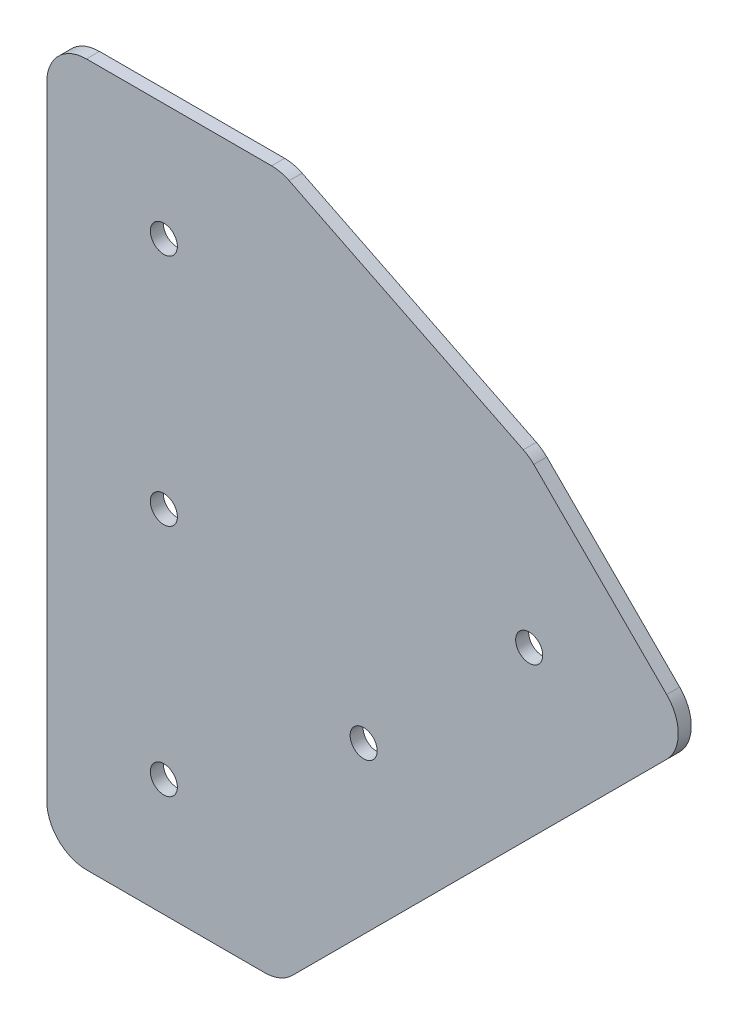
ISO-10303-21;
HEADER;
FILE_DESCRIPTION(('STEP AP214'),'2;1');
FILE_NAME('part.step','',(''),(''),'','','');
FILE_SCHEMA(('AUTOMOTIVE_DESIGN { 1 0 10303 214 1 1 1 1 }'));
ENDSEC;
DATA;
#1=APPLICATION_CONTEXT('core data for automotive mechanical design processes');
#2=APPLICATION_PROTOCOL_DEFINITION('international standard','automotive_design',2000,#1);
#3=PRODUCT_CONTEXT('',#1,'mechanical');
#4=PRODUCT('Part','Part','',(#3));
#5=PRODUCT_RELATED_PRODUCT_CATEGORY('part','',(#4));
#6=PRODUCT_DEFINITION_FORMATION('','',#4);
#7=PRODUCT_DEFINITION_CONTEXT('part definition',#1,'design');
#8=PRODUCT_DEFINITION('design','',#6,#7);
#9=PRODUCT_DEFINITION_SHAPE('','',#8);
#10=(LENGTH_UNIT() NAMED_UNIT(*) SI_UNIT(.MILLI.,.METRE.));
#11=(NAMED_UNIT(*) PLANE_ANGLE_UNIT() SI_UNIT($,.RADIAN.));
#12=(NAMED_UNIT(*) SI_UNIT($,.STERADIAN.) SOLID_ANGLE_UNIT());
#13=UNCERTAINTY_MEASURE_WITH_UNIT(LENGTH_MEASURE(1.E-05),#10,'distance_accuracy_value','');
#14=(GEOMETRIC_REPRESENTATION_CONTEXT(3) GLOBAL_UNCERTAINTY_ASSIGNED_CONTEXT((#13)) GLOBAL_UNIT_ASSIGNED_CONTEXT((#10,
#11,#12)) REPRESENTATION_CONTEXT('',''));
#15=CARTESIAN_POINT('',(0.,0.,0.));
#16=DIRECTION('',(0.,0.,1.));
#17=DIRECTION('',(1.,0.,0.));
#18=AXIS2_PLACEMENT_3D('',#15,#16,#17);
#19=CARTESIAN_POINT('',(59.4458697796,70.157011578,0.));
#20=DIRECTION('',(-0.707106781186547,-0.707106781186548,0.));
#21=DIRECTION('',(0.707106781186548,-0.707106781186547,0.));
#22=AXIS2_PLACEMENT_3D('',#19,#20,#21);
#23=PLANE('',#22);
#24=DIRECTION('',(0.,0.,-1.));
#25=VECTOR('',#24,1.);
#26=CARTESIAN_POINT('',(59.4458697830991,70.1570115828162,0.79375));
#27=LINE('',#26,#25);
#28=CARTESIAN_POINT('',(59.4458697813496,70.1570115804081,0.));
#29=VERTEX_POINT('',#28);
#30=CARTESIAN_POINT('',(59.4458697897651,70.1570115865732,1.5875));
#31=VERTEX_POINT('',#30);
#32=EDGE_CURVE('E159',#29,#31,#27,.F.);
#33=ORIENTED_EDGE('',*,*,#32,.T.);
#34=DIRECTION('',(-0.707106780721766,0.707106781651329,0.));
#35=VECTOR('',#34,1.);
#36=CARTESIAN_POINT('',(75.6652180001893,53.93766336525,1.5875));
#37=LINE('',#36,#35);
#38=CARTESIAN_POINT('',(75.6652180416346,53.9376633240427,1.5875));
#39=VERTEX_POINT('',#38);
#40=EDGE_CURVE('E193',#39,#31,#37,.T.);
#41=ORIENTED_EDGE('',*,*,#40,.F.);
#42=DIRECTION('',(0.,0.,1.));
#43=VECTOR('',#42,1.);
#44=CARTESIAN_POINT('',(75.6652180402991,53.9376633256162,0.79375));
#45=LINE('',#44,#43);
#46=CARTESIAN_POINT('',(75.6652180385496,53.9376633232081,0.));
#47=VERTEX_POINT('',#46);
#48=EDGE_CURVE('E131',#39,#47,#45,.F.);
#49=ORIENTED_EDGE('',*,*,#48,.T.);
#50=DIRECTION('',(0.707106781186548,-0.707106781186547,0.));
#51=VECTOR('',#50,1.);
#52=CARTESIAN_POINT('',(59.4458697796,70.157011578,0.));
#53=LINE('',#52,#51);
#54=EDGE_CURVE('E212',#47,#29,#53,.F.);
#55=ORIENTED_EDGE('',*,*,#54,.T.);
#56=EDGE_LOOP('',(#33,#41,#49,#55));
#57=FACE_BOUND('',#56,.T.);
#58=ADVANCED_FACE('F16',(#57),#23,.F.);
#59=CARTESIAN_POINT('',(56.0221471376,66.733288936,1.5875));
#60=DIRECTION('',(0.,0.,-1.));
#61=DIRECTION('',(0.,1.,0.));
#62=AXIS2_PLACEMENT_3D('',#59,#60,#61);
#63=CYLINDRICAL_SURFACE('',#62,4.84187500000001);
#64=ORIENTED_EDGE('',*,*,#32,.F.);
#65=CARTESIAN_POINT('',(56.0221471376,66.733288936,0.));
#66=DIRECTION('',(0.,0.,-1.));
#67=DIRECTION('',(0.,1.,0.));
#68=AXIS2_PLACEMENT_3D('',#65,#66,#67);
#69=CIRCLE('',#68,4.84187500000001);
#70=CARTESIAN_POINT('',(58.1704515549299,71.0724756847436,0.));
#71=VERTEX_POINT('',#70);
#72=EDGE_CURVE('E209',#29,#71,#69,.F.);
#73=ORIENTED_EDGE('',*,*,#72,.T.);
#74=DIRECTION('',(0.,0.,1.));
#75=VECTOR('',#74,1.);
#76=CARTESIAN_POINT('',(58.1704515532,71.0724756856,0.79375));
#77=LINE('',#76,#75);
#78=CARTESIAN_POINT('',(58.1704515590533,71.0724756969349,1.5875));
#79=VERTEX_POINT('',#78);
#80=EDGE_CURVE('E156',#71,#79,#77,.T.);
#81=ORIENTED_EDGE('',*,*,#80,.T.);
#82=CARTESIAN_POINT('',(56.0221471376,66.733288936,1.5875));
#83=DIRECTION('',(0.,0.,-1.));
#84=DIRECTION('',(0.,1.,0.));
#85=AXIS2_PLACEMENT_3D('',#82,#83,#84);
#86=CIRCLE('',#85,4.84187500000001);
#87=EDGE_CURVE('E191',#31,#79,#86,.F.);
#88=ORIENTED_EDGE('',*,*,#87,.F.);
#89=EDGE_LOOP('',(#64,#73,#81,#88));
#90=FACE_BOUND('',#89,.T.);
#91=ADVANCED_FACE('F295',(#90),#63,.T.);
#92=CARTESIAN_POINT('',(29.5903394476,85.2223117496,0.));
#93=DIRECTION('',(-0.443692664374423,-0.896179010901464,0.));
#94=DIRECTION('',(0.896179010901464,-0.443692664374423,0.));
#95=AXIS2_PLACEMENT_3D('',#92,#93,#94);
#96=PLANE('',#95);
#97=ORIENTED_EDGE('',*,*,#80,.F.);
#98=DIRECTION('',(0.896179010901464,-0.443692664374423,0.));
#99=VECTOR('',#98,1.);
#100=CARTESIAN_POINT('',(29.5903394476,85.2223117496,0.));
#101=LINE('',#100,#99);
#102=CARTESIAN_POINT('',(29.5903394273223,85.2223117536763,0.));
#103=VERTEX_POINT('',#102);
#104=EDGE_CURVE('E207',#71,#103,#101,.F.);
#105=ORIENTED_EDGE('',*,*,#104,.T.);
#106=DIRECTION('',(0.,0.,-1.));
#107=VECTOR('',#106,1.);
#108=CARTESIAN_POINT('',(29.5903394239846,85.2223117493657,0.79375));
#109=LINE('',#108,#107);
#110=CARTESIAN_POINT('',(29.5903394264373,85.2223117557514,1.5875));
#111=VERTEX_POINT('',#110);
#112=EDGE_CURVE('E104',#103,#111,#109,.F.);
#113=ORIENTED_EDGE('',*,*,#112,.T.);
#114=DIRECTION('',(-0.896179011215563,0.443692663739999,0.));
#115=VECTOR('',#114,1.);
#116=CARTESIAN_POINT('',(58.1704515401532,71.072475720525,1.5875));
#117=LINE('',#116,#115);
#118=EDGE_CURVE('E189',#79,#111,#117,.T.);
#119=ORIENTED_EDGE('',*,*,#118,.F.);
#120=EDGE_LOOP('',(#97,#105,#113,#119));
#121=FACE_BOUND('',#120,.T.);
#122=ADVANCED_FACE('F294',(#121),#96,.F.);
#123=CARTESIAN_POINT('',(27.4420350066,80.883125,1.5875));
#124=DIRECTION('',(0.,0.,-1.));
#125=DIRECTION('',(0.,1.,0.));
#126=AXIS2_PLACEMENT_3D('',#123,#124,#125);
#127=CYLINDRICAL_SURFACE('',#126,4.841875);
#128=ORIENTED_EDGE('',*,*,#112,.F.);
#129=CARTESIAN_POINT('',(27.4420350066,80.883125,0.));
#130=DIRECTION('',(0.,0.,-1.));
#131=DIRECTION('',(0.,1.,0.));
#132=AXIS2_PLACEMENT_3D('',#129,#130,#131);
#133=CIRCLE('',#132,4.841875);
#134=CARTESIAN_POINT('',(27.4420350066,85.725,0.));
#135=VERTEX_POINT('',#134);
#136=EDGE_CURVE('E20',#103,#135,#133,.F.);
#137=ORIENTED_EDGE('',*,*,#136,.T.);
#138=DIRECTION('',(0.,0.,1.));
#139=VECTOR('',#138,1.);
#140=CARTESIAN_POINT('',(27.4420350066,85.725,0.79375));
#141=LINE('',#140,#139);
#142=CARTESIAN_POINT('',(27.4420350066,85.725,1.5875));
#143=VERTEX_POINT('',#142);
#144=EDGE_CURVE('E111',#135,#143,#141,.T.);
#145=ORIENTED_EDGE('',*,*,#144,.T.);
#146=CARTESIAN_POINT('',(27.4420350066,80.883125,1.5875));
#147=DIRECTION('',(0.,0.,-1.));
#148=DIRECTION('',(0.,1.,0.));
#149=AXIS2_PLACEMENT_3D('',#146,#147,#148);
#150=CIRCLE('',#149,4.841875);
#151=EDGE_CURVE('E187',#111,#143,#150,.F.);
#152=ORIENTED_EDGE('',*,*,#151,.F.);
#153=EDGE_LOOP('',(#128,#137,#145,#152));
#154=FACE_BOUND('',#153,.T.);
#155=ADVANCED_FACE('F129',(#154),#127,.T.);
#156=CARTESIAN_POINT('',(4.841875,85.725,1.5875));
#157=DIRECTION('',(0.,-1.,0.));
#158=DIRECTION('',(0.,0.,-1.));
#159=AXIS2_PLACEMENT_3D('',#156,#157,#158);
#160=PLANE('',#159);
#161=ORIENTED_EDGE('',*,*,#144,.F.);
#162=DIRECTION('',(-1.,0.,0.));
#163=VECTOR('',#162,1.);
#164=CARTESIAN_POINT('',(38.7729353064,85.725,0.));
#165=LINE('',#164,#163);
#166=CARTESIAN_POINT('',(4.84187500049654,85.725,0.));
#167=VERTEX_POINT('',#166);
#168=EDGE_CURVE('E115',#135,#167,#165,.T.);
#169=ORIENTED_EDGE('',*,*,#168,.T.);
#170=DIRECTION('',(0.,0.,-1.));
#171=VECTOR('',#170,1.);
#172=CARTESIAN_POINT('',(4.84187500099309,85.725,0.79375));
#173=LINE('',#172,#171);
#174=CARTESIAN_POINT('',(4.84187500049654,85.725,1.5875));
#175=VERTEX_POINT('',#174);
#176=EDGE_CURVE('E117',#167,#175,#173,.F.);
#177=ORIENTED_EDGE('',*,*,#176,.T.);
#178=DIRECTION('',(-1.,0.,0.));
#179=VECTOR('',#178,1.);
#180=CARTESIAN_POINT('',(38.7729353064,85.725,1.5875));
#181=LINE('',#180,#179);
#182=EDGE_CURVE('E116',#143,#175,#181,.T.);
#183=ORIENTED_EDGE('',*,*,#182,.F.);
#184=EDGE_LOOP('',(#161,#169,#177,#183));
#185=FACE_BOUND('',#184,.T.);
#186=ADVANCED_FACE('F113',(#185),#160,.F.);
#187=CARTESIAN_POINT('',(4.841875,80.883125,1.5875));
#188=DIRECTION('',(0.,0.,-1.));
#189=DIRECTION('',(0.,1.,0.));
#190=AXIS2_PLACEMENT_3D('',#187,#188,#189);
#191=CYLINDRICAL_SURFACE('',#190,4.841875);
#192=ORIENTED_EDGE('',*,*,#176,.F.);
#193=CARTESIAN_POINT('',(4.841875,80.883125,0.));
#194=DIRECTION('',(0.,0.,-1.));
#195=DIRECTION('',(0.,1.,0.));
#196=AXIS2_PLACEMENT_3D('',#193,#194,#195);
#197=CIRCLE('',#196,4.841875);
#198=CARTESIAN_POINT('',(0.,80.883125,0.));
#199=VERTEX_POINT('',#198);
#200=EDGE_CURVE('E127',#167,#199,#197,.F.);
#201=ORIENTED_EDGE('',*,*,#200,.T.);
#202=DIRECTION('',(0.,0.,1.));
#203=VECTOR('',#202,1.);
#204=CARTESIAN_POINT('',(0.,80.883125,0.79375));
#205=LINE('',#204,#203);
#206=CARTESIAN_POINT('',(0.,80.883125,1.5875));
#207=VERTEX_POINT('',#206);
#208=EDGE_CURVE('E151',#199,#207,#205,.T.);
#209=ORIENTED_EDGE('',*,*,#208,.T.);
#210=CARTESIAN_POINT('',(4.841875,80.883125,1.5875));
#211=DIRECTION('',(0.,0.,-1.));
#212=DIRECTION('',(0.,1.,0.));
#213=AXIS2_PLACEMENT_3D('',#210,#211,#212);
#214=CIRCLE('',#213,4.841875);
#215=EDGE_CURVE('E185',#175,#207,#214,.F.);
#216=ORIENTED_EDGE('',*,*,#215,.F.);
#217=EDGE_LOOP('',(#192,#201,#209,#216));
#218=FACE_BOUND('',#217,.T.);
#219=ADVANCED_FACE('F289',(#218),#191,.T.);
#220=CARTESIAN_POINT('',(0.,4.841875,1.5875));
#221=DIRECTION('',(1.,0.,0.));
#222=DIRECTION('',(0.,0.,-1.));
#223=AXIS2_PLACEMENT_3D('',#220,#221,#222);
#224=PLANE('',#223);
#225=DIRECTION('',(0.,0.,-1.));
#226=VECTOR('',#225,1.);
#227=CARTESIAN_POINT('',(0.,4.84187499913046,0.79375));
#228=LINE('',#227,#226);
#229=CARTESIAN_POINT('',(0.,4.84187499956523,0.));
#230=VERTEX_POINT('',#229);
#231=CARTESIAN_POINT('',(0.,4.84187499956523,1.5875));
#232=VERTEX_POINT('',#231);
#233=EDGE_CURVE('E148',#230,#232,#228,.F.);
#234=ORIENTED_EDGE('',*,*,#233,.T.);
#235=DIRECTION('',(0.,-1.,0.));
#236=VECTOR('',#235,1.);
#237=CARTESIAN_POINT('',(0.,42.8625,1.5875));
#238=LINE('',#237,#236);
#239=EDGE_CURVE('E184',#207,#232,#238,.T.);
#240=ORIENTED_EDGE('',*,*,#239,.F.);
#241=ORIENTED_EDGE('',*,*,#208,.F.);
#242=DIRECTION('',(0.,-1.,0.));
#243=VECTOR('',#242,1.);
#244=CARTESIAN_POINT('',(0.,42.8625,0.));
#245=LINE('',#244,#243);
#246=EDGE_CURVE('E226',#199,#230,#245,.T.);
#247=ORIENTED_EDGE('',*,*,#246,.T.);
#248=EDGE_LOOP('',(#234,#240,#241,#247));
#249=FACE_BOUND('',#248,.T.);
#250=ADVANCED_FACE('F287',(#249),#224,.F.);
#251=CARTESIAN_POINT('',(4.841875,4.841875,1.5875));
#252=DIRECTION('',(0.,0.,-1.));
#253=DIRECTION('',(0.,1.,0.));
#254=AXIS2_PLACEMENT_3D('',#251,#252,#253);
#255=CYLINDRICAL_SURFACE('',#254,4.841875);
#256=ORIENTED_EDGE('',*,*,#233,.F.);
#257=CARTESIAN_POINT('',(4.841875,4.841875,0.));
#258=DIRECTION('',(0.,0.,-1.));
#259=DIRECTION('',(0.,1.,0.));
#260=AXIS2_PLACEMENT_3D('',#257,#258,#259);
#261=CIRCLE('',#260,4.841875);
#262=CARTESIAN_POINT('',(4.841875,0.,0.));
#263=VERTEX_POINT('',#262);
#264=EDGE_CURVE('E224',#230,#263,#261,.F.);
#265=ORIENTED_EDGE('',*,*,#264,.T.);
#266=DIRECTION('',(0.,0.,1.));
#267=VECTOR('',#266,1.);
#268=CARTESIAN_POINT('',(4.841875,0.,0.79375));
#269=LINE('',#268,#267);
#270=CARTESIAN_POINT('',(4.841875,0.,1.5875));
#271=VERTEX_POINT('',#270);
#272=EDGE_CURVE('E145',#263,#271,#269,.T.);
#273=ORIENTED_EDGE('',*,*,#272,.T.);
#274=CARTESIAN_POINT('',(4.841875,4.841875,1.5875));
#275=DIRECTION('',(0.,0.,-1.));
#276=DIRECTION('',(0.,1.,0.));
#277=AXIS2_PLACEMENT_3D('',#274,#275,#276);
#278=CIRCLE('',#277,4.841875);
#279=EDGE_CURVE('E182',#232,#271,#278,.F.);
#280=ORIENTED_EDGE('',*,*,#279,.F.);
#281=EDGE_LOOP('',(#256,#265,#273,#280));
#282=FACE_BOUND('',#281,.T.);
#283=ADVANCED_FACE('F284',(#282),#255,.T.);
#284=CARTESIAN_POINT('',(4.841875,0.,0.));
#285=DIRECTION('',(0.,1.,0.));
#286=DIRECTION('',(0.,0.,1.));
#287=AXIS2_PLACEMENT_3D('',#284,#285,#286);
#288=PLANE('',#287);
#289=ORIENTED_EDGE('',*,*,#272,.F.);
#290=DIRECTION('',(1.,0.,0.));
#291=VECTOR('',#290,1.);
#292=CARTESIAN_POINT('',(38.7729353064,0.,0.));
#293=LINE('',#292,#291);
#294=CARTESIAN_POINT('',(26.5694297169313,0.,0.));
#295=VERTEX_POINT('',#294);
#296=EDGE_CURVE('E223',#263,#295,#293,.T.);
#297=ORIENTED_EDGE('',*,*,#296,.T.);
#298=DIRECTION('',(0.,0.,-1.));
#299=VECTOR('',#298,1.);
#300=CARTESIAN_POINT('',(26.5694297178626,0.,0.79375));
#301=LINE('',#300,#299);
#302=CARTESIAN_POINT('',(26.5694297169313,0.,1.5875));
#303=VERTEX_POINT('',#302);
#304=EDGE_CURVE('E142',#295,#303,#301,.F.);
#305=ORIENTED_EDGE('',*,*,#304,.T.);
#306=DIRECTION('',(1.,0.,0.));
#307=VECTOR('',#306,1.);
#308=CARTESIAN_POINT('',(38.7729353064,0.,1.5875));
#309=LINE('',#308,#307);
#310=EDGE_CURVE('E181',#271,#303,#309,.T.);
#311=ORIENTED_EDGE('',*,*,#310,.F.);
#312=EDGE_LOOP('',(#289,#297,#305,#311));
#313=FACE_BOUND('',#312,.T.);
#314=ADVANCED_FACE('F239',(#313),#288,.F.);
#315=CARTESIAN_POINT('',(26.569429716,4.841875,1.5875));
#316=DIRECTION('',(0.,0.,-1.));
#317=DIRECTION('',(0.,1.,0.));
#318=AXIS2_PLACEMENT_3D('',#315,#316,#317);
#319=CYLINDRICAL_SURFACE('',#318,4.84187500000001);
#320=ORIENTED_EDGE('',*,*,#304,.F.);
#321=CARTESIAN_POINT('',(26.569429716,4.841875,0.));
#322=DIRECTION('',(0.,0.,-1.));
#323=DIRECTION('',(0.,1.,0.));
#324=AXIS2_PLACEMENT_3D('',#321,#322,#323);
#325=CIRCLE('',#324,4.84187500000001);
#326=CARTESIAN_POINT('',(29.993152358,1.418152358,0.));
#327=VERTEX_POINT('',#326);
#328=EDGE_CURVE('E220',#295,#327,#325,.F.);
#329=ORIENTED_EDGE('',*,*,#328,.T.);
#330=DIRECTION('',(0.,0.,1.));
#331=VECTOR('',#330,1.);
#332=CARTESIAN_POINT('',(29.993152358,1.418152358,0.79375));
#333=LINE('',#332,#331);
#334=CARTESIAN_POINT('',(29.9931523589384,1.41815235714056,1.5875));
#335=VERTEX_POINT('',#334);
#336=EDGE_CURVE('E136',#327,#335,#333,.T.);
#337=ORIENTED_EDGE('',*,*,#336,.T.);
#338=CARTESIAN_POINT('',(26.569429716,4.841875,1.5875));
#339=DIRECTION('',(0.,0.,-1.));
#340=DIRECTION('',(0.,1.,0.));
#341=AXIS2_PLACEMENT_3D('',#338,#339,#340);
#342=CIRCLE('',#341,4.84187500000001);
#343=EDGE_CURVE('E179',#303,#335,#342,.F.);
#344=ORIENTED_EDGE('',*,*,#343,.F.);
#345=EDGE_LOOP('',(#320,#329,#337,#344));
#346=FACE_BOUND('',#345,.T.);
#347=ADVANCED_FACE('F243',(#346),#319,.T.);
#348=CARTESIAN_POINT('',(75.6652180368,47.0902180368,0.));
#349=DIRECTION('',(-0.707106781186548,0.707106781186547,0.));
#350=DIRECTION('',(-0.707106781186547,-0.707106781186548,0.));
#351=AXIS2_PLACEMENT_3D('',#348,#349,#350);
#352=PLANE('',#351);
#353=ORIENTED_EDGE('',*,*,#336,.F.);
#354=DIRECTION('',(-0.707106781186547,-0.707106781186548,0.));
#355=VECTOR('',#354,1.);
#356=CARTESIAN_POINT('',(75.6652180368,47.0902180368,0.));
#357=LINE('',#356,#355);
#358=CARTESIAN_POINT('',(75.665218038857,47.0902180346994,0.));
#359=VERTEX_POINT('',#358);
#360=EDGE_CURVE('E218',#327,#359,#357,.F.);
#361=ORIENTED_EDGE('',*,*,#360,.T.);
#362=DIRECTION('',(0.,0.,-1.));
#363=VECTOR('',#362,1.);
#364=CARTESIAN_POINT('',(75.6652180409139,47.0902180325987,0.79375));
#365=LINE('',#364,#363);
#366=CARTESIAN_POINT('',(75.6652180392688,47.0902180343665,1.5875));
#367=VERTEX_POINT('',#366);
#368=EDGE_CURVE('E130',#359,#367,#365,.F.);
#369=ORIENTED_EDGE('',*,*,#368,.T.);
#370=DIRECTION('',(0.707106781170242,0.707106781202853,0.));
#371=VECTOR('',#370,1.);
#372=CARTESIAN_POINT('',(29.9931523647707,1.418152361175,1.5875));
#373=LINE('',#372,#371);
#374=EDGE_CURVE('E35',#335,#367,#373,.T.);
#375=ORIENTED_EDGE('',*,*,#374,.F.);
#376=EDGE_LOOP('',(#353,#361,#369,#375));
#377=FACE_BOUND('',#376,.T.);
#378=ADVANCED_FACE('F245',(#377),#352,.F.);
#379=CARTESIAN_POINT('',(72.2414953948,50.5139406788,1.5875));
#380=DIRECTION('',(0.,0.,-1.));
#381=DIRECTION('',(0.,1.,0.));
#382=AXIS2_PLACEMENT_3D('',#379,#380,#381);
#383=CYLINDRICAL_SURFACE('',#382,4.841875);
#384=ORIENTED_EDGE('',*,*,#368,.F.);
#385=CARTESIAN_POINT('',(72.2414953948,50.5139406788,0.));
#386=DIRECTION('',(0.,0.,-1.));
#387=DIRECTION('',(0.,1.,0.));
#388=AXIS2_PLACEMENT_3D('',#385,#386,#387);
#389=CIRCLE('',#388,4.841875);
#390=EDGE_CURVE('E215',#359,#47,#389,.F.);
#391=ORIENTED_EDGE('',*,*,#390,.T.);
#392=ORIENTED_EDGE('',*,*,#48,.F.);
#393=CARTESIAN_POINT('',(72.2414953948,50.5139406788,1.5875));
#394=DIRECTION('',(0.,0.,-1.));
#395=DIRECTION('',(0.,1.,0.));
#396=AXIS2_PLACEMENT_3D('',#393,#394,#395);
#397=CIRCLE('',#396,4.841875);
#398=EDGE_CURVE('E176',#367,#39,#397,.F.);
#399=ORIENTED_EDGE('',*,*,#398,.F.);
#400=EDGE_LOOP('',(#384,#391,#392,#399));
#401=FACE_BOUND('',#400,.T.);
#402=ADVANCED_FACE('F247',(#401),#383,.T.);
#403=CARTESIAN_POINT('',(58.8833644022,50.5139406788,0.));
#404=DIRECTION('',(0.,0.,1.));
#405=DIRECTION('',(1.,0.,0.));
#406=AXIS2_PLACEMENT_3D('',#403,#404,#405);
#407=CYLINDRICAL_SURFACE('',#406,1.65100000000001);
#408=CARTESIAN_POINT('',(58.8833644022,50.5139406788,1.5875));
#409=DIRECTION('',(0.,0.,1.));
#410=DIRECTION('',(1.,0.,0.));
#411=AXIS2_PLACEMENT_3D('',#408,#409,#410);
#412=CIRCLE('',#411,1.65100000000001);
#413=CARTESIAN_POINT('',(60.5343644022,50.5139406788,1.5875));
#414=VERTEX_POINT('',#413);
#415=EDGE_CURVE('E173',#414,#414,#412,.F.);
#416=ORIENTED_EDGE('',*,*,#415,.F.);
#417=EDGE_LOOP('',(#416));
#418=FACE_BOUND('',#417,.T.);
#419=CARTESIAN_POINT('',(58.8833644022,50.5139406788,0.));
#420=DIRECTION('',(0.,0.,1.));
#421=DIRECTION('',(1.,0.,0.));
#422=AXIS2_PLACEMENT_3D('',#419,#420,#421);
#423=CIRCLE('',#422,1.65100000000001);
#424=CARTESIAN_POINT('',(60.5343644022,50.5139406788,0.));
#425=VERTEX_POINT('',#424);
#426=EDGE_CURVE('E204',#425,#425,#423,.F.);
#427=ORIENTED_EDGE('',*,*,#426,.T.);
#428=EDGE_LOOP('',(#427));
#429=FACE_BOUND('',#428,.T.);
#430=ADVANCED_FACE('F254',(#418,#429),#407,.F.);
#431=CARTESIAN_POINT('',(38.6777881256,30.3083644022,0.));
#432=DIRECTION('',(0.,0.,1.));
#433=DIRECTION('',(1.,0.,0.));
#434=AXIS2_PLACEMENT_3D('',#431,#432,#433);
#435=CYLINDRICAL_SURFACE('',#434,1.651);
#436=CARTESIAN_POINT('',(38.6777881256,30.3083644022,1.5875));
#437=DIRECTION('',(0.,0.,1.));
#438=DIRECTION('',(1.,0.,0.));
#439=AXIS2_PLACEMENT_3D('',#436,#437,#438);
#440=CIRCLE('',#439,1.651);
#441=CARTESIAN_POINT('',(40.3287881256,30.3083644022,1.5875));
#442=VERTEX_POINT('',#441);
#443=EDGE_CURVE('E170',#442,#442,#440,.F.);
#444=ORIENTED_EDGE('',*,*,#443,.F.);
#445=EDGE_LOOP('',(#444));
#446=FACE_BOUND('',#445,.T.);
#447=CARTESIAN_POINT('',(38.6777881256,30.3083644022,0.));
#448=DIRECTION('',(0.,0.,1.));
#449=DIRECTION('',(1.,0.,0.));
#450=AXIS2_PLACEMENT_3D('',#447,#448,#449);
#451=CIRCLE('',#450,1.651);
#452=CARTESIAN_POINT('',(40.3287881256,30.3083644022,0.));
#453=VERTEX_POINT('',#452);
#454=EDGE_CURVE('E201',#453,#453,#451,.F.);
#455=ORIENTED_EDGE('',*,*,#454,.T.);
#456=EDGE_LOOP('',(#455));
#457=FACE_BOUND('',#456,.T.);
#458=ADVANCED_FACE('F276',(#446,#457),#435,.F.);
#459=CARTESIAN_POINT('',(14.2875,14.2875,0.));
#460=DIRECTION('',(0.,0.,1.));
#461=DIRECTION('',(1.,0.,0.));
#462=AXIS2_PLACEMENT_3D('',#459,#460,#461);
#463=CYLINDRICAL_SURFACE('',#462,1.651);
#464=CARTESIAN_POINT('',(14.2875,14.2875,1.5875));
#465=DIRECTION('',(0.,0.,1.));
#466=DIRECTION('',(1.,0.,0.));
#467=AXIS2_PLACEMENT_3D('',#464,#465,#466);
#468=CIRCLE('',#467,1.651);
#469=CARTESIAN_POINT('',(15.9385,14.2875,1.5875));
#470=VERTEX_POINT('',#469);
#471=EDGE_CURVE('E167',#470,#470,#468,.F.);
#472=ORIENTED_EDGE('',*,*,#471,.F.);
#473=EDGE_LOOP('',(#472));
#474=FACE_BOUND('',#473,.T.);
#475=CARTESIAN_POINT('',(14.2875,14.2875,0.));
#476=DIRECTION('',(0.,0.,1.));
#477=DIRECTION('',(1.,0.,0.));
#478=AXIS2_PLACEMENT_3D('',#475,#476,#477);
#479=CIRCLE('',#478,1.651);
#480=CARTESIAN_POINT('',(15.9385,14.2875,0.));
#481=VERTEX_POINT('',#480);
#482=EDGE_CURVE('E198',#481,#481,#479,.F.);
#483=ORIENTED_EDGE('',*,*,#482,.T.);
#484=EDGE_LOOP('',(#483));
#485=FACE_BOUND('',#484,.T.);
#486=ADVANCED_FACE('F272',(#474,#485),#463,.F.);
#487=CARTESIAN_POINT('',(14.2875,42.8625,0.));
#488=DIRECTION('',(0.,0.,1.));
#489=DIRECTION('',(1.,0.,0.));
#490=AXIS2_PLACEMENT_3D('',#487,#488,#489);
#491=CYLINDRICAL_SURFACE('',#490,1.651);
#492=CARTESIAN_POINT('',(14.2875,42.8625,1.5875));
#493=DIRECTION('',(0.,0.,1.));
#494=DIRECTION('',(1.,0.,0.));
#495=AXIS2_PLACEMENT_3D('',#492,#493,#494);
#496=CIRCLE('',#495,1.651);
#497=CARTESIAN_POINT('',(15.9385,42.8625,1.5875));
#498=VERTEX_POINT('',#497);
#499=EDGE_CURVE('E164',#498,#498,#496,.F.);
#500=ORIENTED_EDGE('',*,*,#499,.F.);
#501=EDGE_LOOP('',(#500));
#502=FACE_BOUND('',#501,.T.);
#503=CARTESIAN_POINT('',(14.2875,42.8625,0.));
#504=DIRECTION('',(0.,0.,1.));
#505=DIRECTION('',(1.,0.,0.));
#506=AXIS2_PLACEMENT_3D('',#503,#504,#505);
#507=CIRCLE('',#506,1.651);
#508=CARTESIAN_POINT('',(15.9385,42.8625,0.));
#509=VERTEX_POINT('',#508);
#510=EDGE_CURVE('E195',#509,#509,#507,.F.);
#511=ORIENTED_EDGE('',*,*,#510,.T.);
#512=EDGE_LOOP('',(#511));
#513=FACE_BOUND('',#512,.T.);
#514=ADVANCED_FACE('F269',(#502,#513),#491,.F.);
#515=CARTESIAN_POINT('',(0.,0.,0.));
#516=DIRECTION('',(0.,0.,1.));
#517=DIRECTION('',(1.,0.,0.));
#518=AXIS2_PLACEMENT_3D('',#515,#516,#517);
#519=PLANE('',#518);
#520=ORIENTED_EDGE('',*,*,#510,.F.);
#521=EDGE_LOOP('',(#520));
#522=FACE_BOUND('',#521,.T.);
#523=ORIENTED_EDGE('',*,*,#482,.F.);
#524=EDGE_LOOP('',(#523));
#525=FACE_BOUND('',#524,.T.);
#526=ORIENTED_EDGE('',*,*,#454,.F.);
#527=EDGE_LOOP('',(#526));
#528=FACE_BOUND('',#527,.T.);
#529=ORIENTED_EDGE('',*,*,#426,.F.);
#530=EDGE_LOOP('',(#529));
#531=FACE_BOUND('',#530,.T.);
#532=CARTESIAN_POINT('',(14.2875,71.4375,0.));
#533=DIRECTION('',(0.,0.,1.));
#534=DIRECTION('',(1.,0.,0.));
#535=AXIS2_PLACEMENT_3D('',#532,#533,#534);
#536=CIRCLE('',#535,1.651);
#537=CARTESIAN_POINT('',(15.9385,71.4375,0.));
#538=VERTEX_POINT('',#537);
#539=EDGE_CURVE('E26',#538,#538,#536,.F.);
#540=ORIENTED_EDGE('',*,*,#539,.F.);
#541=EDGE_LOOP('',(#540));
#542=FACE_BOUND('',#541,.T.);
#543=ORIENTED_EDGE('',*,*,#72,.F.);
#544=ORIENTED_EDGE('',*,*,#54,.F.);
#545=ORIENTED_EDGE('',*,*,#390,.F.);
#546=ORIENTED_EDGE('',*,*,#360,.F.);
#547=ORIENTED_EDGE('',*,*,#328,.F.);
#548=ORIENTED_EDGE('',*,*,#296,.F.);
#549=ORIENTED_EDGE('',*,*,#264,.F.);
#550=ORIENTED_EDGE('',*,*,#246,.F.);
#551=ORIENTED_EDGE('',*,*,#200,.F.);
#552=ORIENTED_EDGE('',*,*,#168,.F.);
#553=ORIENTED_EDGE('',*,*,#136,.F.);
#554=ORIENTED_EDGE('',*,*,#104,.F.);
#555=EDGE_LOOP('',(#543,#544,#545,#546,#547,#548,#549,#550,#551,#552,#553,#554));
#556=FACE_BOUND('',#555,.T.);
#557=ADVANCED_FACE('F122',(#522,#525,#528,#531,#542,#556),#519,.F.);
#558=CARTESIAN_POINT('',(0.,0.,1.5875));
#559=DIRECTION('',(0.,0.,1.));
#560=DIRECTION('',(1.,0.,0.));
#561=AXIS2_PLACEMENT_3D('',#558,#559,#560);
#562=PLANE('',#561);
#563=ORIENTED_EDGE('',*,*,#499,.T.);
#564=EDGE_LOOP('',(#563));
#565=FACE_BOUND('',#564,.T.);
#566=ORIENTED_EDGE('',*,*,#471,.T.);
#567=EDGE_LOOP('',(#566));
#568=FACE_BOUND('',#567,.T.);
#569=ORIENTED_EDGE('',*,*,#443,.T.);
#570=EDGE_LOOP('',(#569));
#571=FACE_BOUND('',#570,.T.);
#572=ORIENTED_EDGE('',*,*,#415,.T.);
#573=EDGE_LOOP('',(#572));
#574=FACE_BOUND('',#573,.T.);
#575=CARTESIAN_POINT('',(14.2875,71.4375,1.5875));
#576=DIRECTION('',(0.,0.,1.));
#577=DIRECTION('',(1.,0.,0.));
#578=AXIS2_PLACEMENT_3D('',#575,#576,#577);
#579=CIRCLE('',#578,1.651);
#580=CARTESIAN_POINT('',(15.9385,71.4375,1.5875));
#581=VERTEX_POINT('',#580);
#582=EDGE_CURVE('E10',#581,#581,#579,.T.);
#583=ORIENTED_EDGE('',*,*,#582,.F.);
#584=EDGE_LOOP('',(#583));
#585=FACE_BOUND('',#584,.T.);
#586=ORIENTED_EDGE('',*,*,#374,.T.);
#587=ORIENTED_EDGE('',*,*,#398,.T.);
#588=ORIENTED_EDGE('',*,*,#40,.T.);
#589=ORIENTED_EDGE('',*,*,#87,.T.);
#590=ORIENTED_EDGE('',*,*,#118,.T.);
#591=ORIENTED_EDGE('',*,*,#151,.T.);
#592=ORIENTED_EDGE('',*,*,#182,.T.);
#593=ORIENTED_EDGE('',*,*,#215,.T.);
#594=ORIENTED_EDGE('',*,*,#239,.T.);
#595=ORIENTED_EDGE('',*,*,#279,.T.);
#596=ORIENTED_EDGE('',*,*,#310,.T.);
#597=ORIENTED_EDGE('',*,*,#343,.T.);
#598=EDGE_LOOP('',(#586,#587,#588,#589,#590,#591,#592,#593,#594,#595,#596,#597));
#599=FACE_BOUND('',#598,.T.);
#600=ADVANCED_FACE('F18',(#565,#568,#571,#574,#585,#599),#562,.T.);
#601=CARTESIAN_POINT('',(14.2875,71.4375,0.));
#602=DIRECTION('',(0.,0.,1.));
#603=DIRECTION('',(1.,0.,0.));
#604=AXIS2_PLACEMENT_3D('',#601,#602,#603);
#605=CYLINDRICAL_SURFACE('',#604,1.651);
#606=ORIENTED_EDGE('',*,*,#539,.T.);
#607=EDGE_LOOP('',(#606));
#608=FACE_BOUND('',#607,.T.);
#609=ORIENTED_EDGE('',*,*,#582,.T.);
#610=EDGE_LOOP('',(#609));
#611=FACE_BOUND('',#610,.T.);
#612=ADVANCED_FACE('F259',(#608,#611),#605,.F.);
#613=CLOSED_SHELL('',(#58,#91,#122,#155,#186,#219,#250,#283,#314,#347,#378,#402,#430,#458,#486,
#514,#557,#600,#612));
#614=MANIFOLD_SOLID_BREP('B1',#613);
#615=ADVANCED_BREP_SHAPE_REPRESENTATION('',(#18,#614),#14);
#616=SHAPE_DEFINITION_REPRESENTATION(#9,#615);
ENDSEC;
END-ISO-10303-21;
